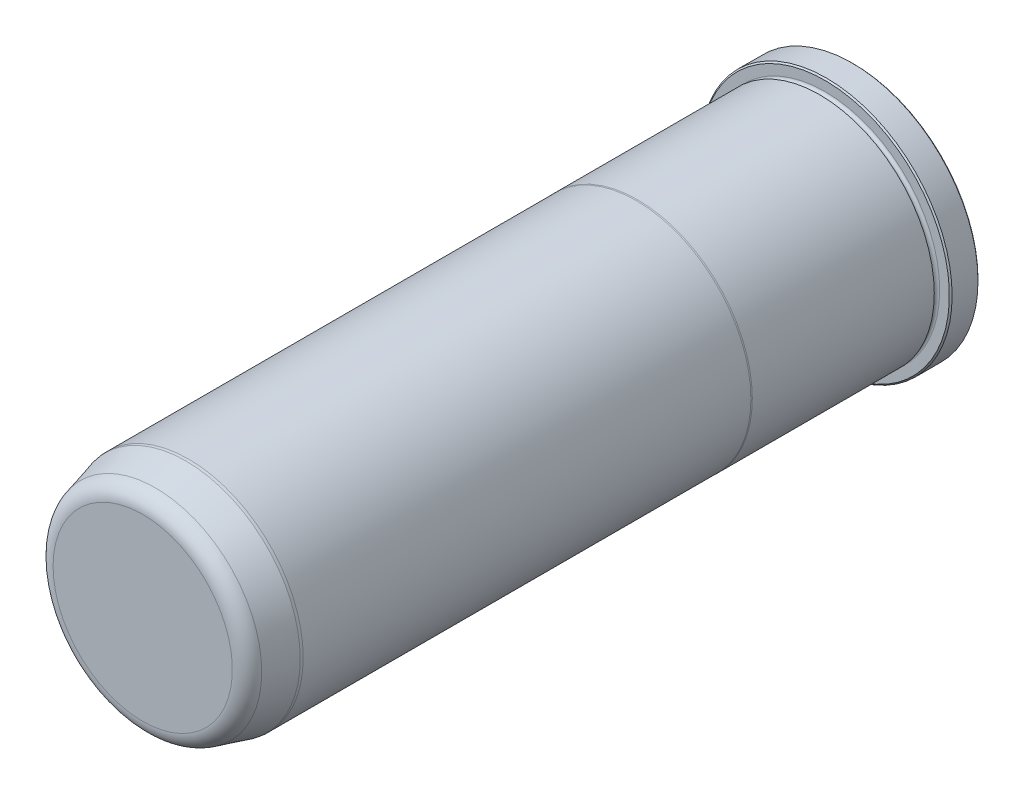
from build123d import *

# Parameters (mm, degrees)
FILLET6_R     = 4.7625
CHAMFER1_SIZE = 0.381


with BuildPart() as part:
    # Sketch1 → Revolve1 (revolve)
    with BuildSketch(Plane(origin=(0, 0, 0), x_dir=(0, 0, -1), z_dir=(1, 0, 0)), mode=Mode.PRIVATE) as revolve1_sk:
        with BuildLine():
            Line((0, 0), (0, 34.798))
            Line((0, 34.798), (-7.9248, 34.798))
            Line((-7.9248, 34.798), (-7.9248, 31.7373))
            ThreePointArc((-7.9248, 31.7373), (-8.6868, 30.9753), (-9.4488, 31.7373))
            Line((-9.4488, 31.7373), (-9.4488, 31.7627))
            Line((-9.4488, 31.7627), (-59.834763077, 31.7627))
            Line((-59.834763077, 31.7627), (-60.198, 31.7373))
            Line((-60.198, 31.7373), (-184.15, 31.7373))
            Line((-184.15, 31.7373), (-184.912, 31.670633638))
            Line((-184.912, 31.670633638), (-196.85, 28.471856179))
            Line((-196.85, 28.471856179), (-196.85, 0))
            Line((-196.85, 0), (0, 0))
        make_face()
    revolve(revolve1_sk.sketch.rotate(Axis((0, 0, 0), (0, 0, -1)), 90), axis=Axis((0, 0, 0), (0, 0, -1)))

    # Fillet6
    fillet6_edges = [part.edges().sort_by_distance(p)[0] for p in [
        (-28.471856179, 0, 196.85),
    ]]
    fillet(fillet6_edges, radius=FILLET6_R)

    # Chamfer1
    chamfer1_edges = [part.edges().sort_by_distance(p)[0] for p in [
        (-34.798, 0, 7.9248),
        (-34.798, 0, 0),
    ]]
    chamfer(chamfer1_edges, length=CHAMFER1_SIZE)


solid = part.part
